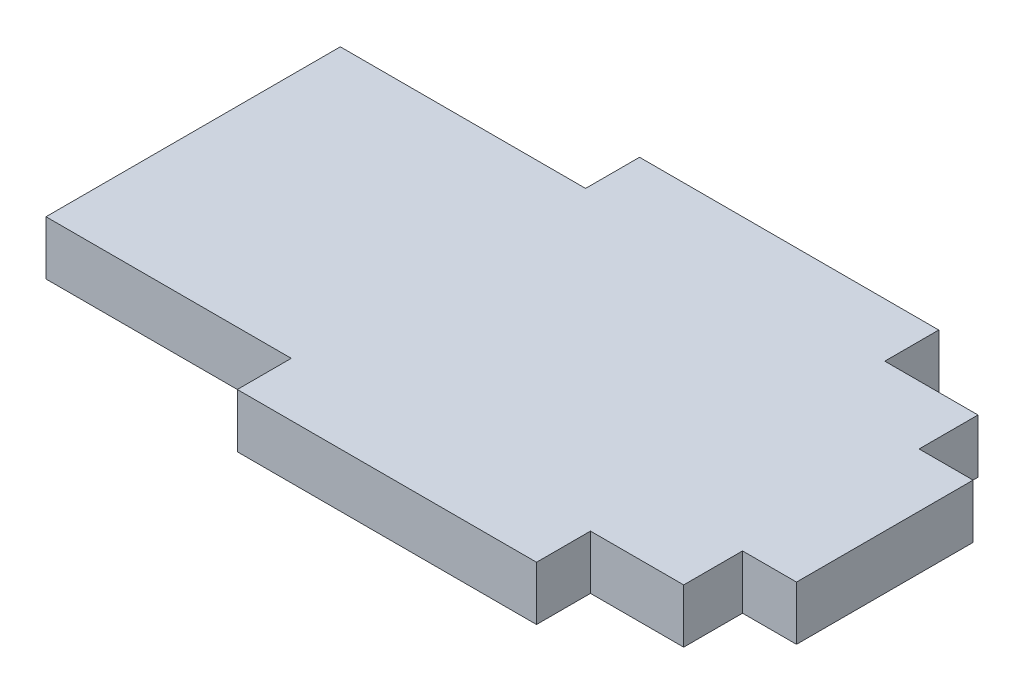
from build123d import *

# Parameters (mm, degrees)
SALIENTE_EXTRUIR1_DEPTH = 5.5


with BuildPart() as part:
    # Croquis1 → Saliente-Extruir1 (new body)
    with BuildSketch(Plane(origin=(0, 0, 0), x_dir=(1, 0, 0), z_dir=(0, 1, 0))):
        Polygon((-7.5, 15), (-7.5, 20.5), (23, 20.5), (23, 15), (32.5, 15), (32.5, 9), (38, 9), (38, -9), (32.5, -9), (32.5, -15), (23, -15), (23, -20.5), (-7.5, -20.5), (-7.5, -15), (-32.5, -15), (-32.5, 15), align=None)
    extrude(amount=SALIENTE_EXTRUIR1_DEPTH)


solid = part.part
